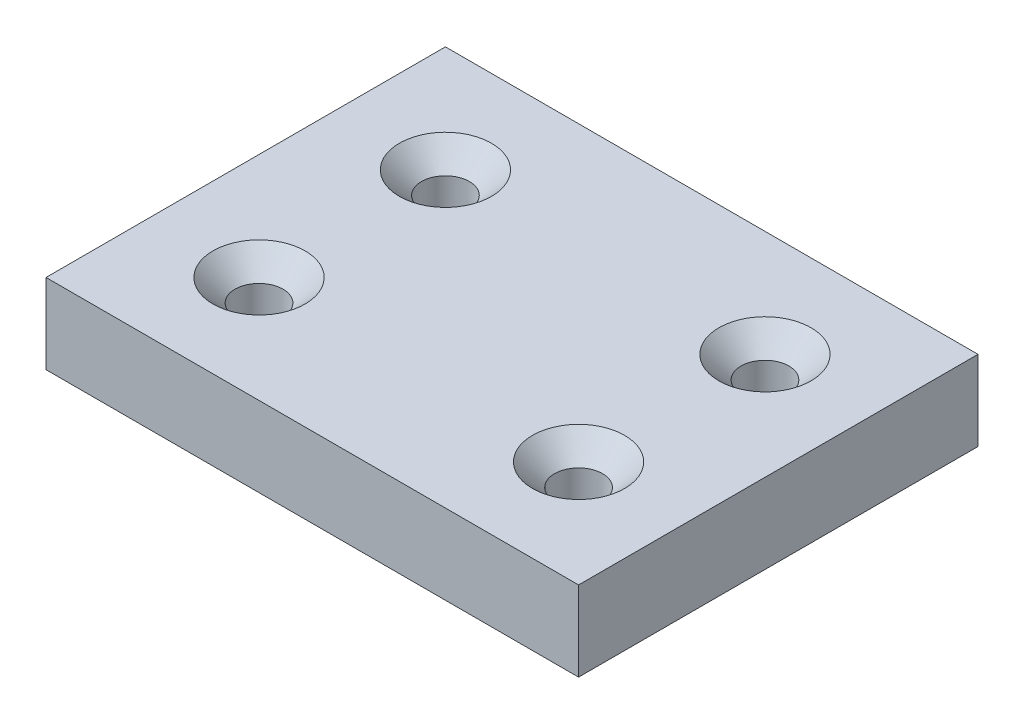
from build123d import *

# Parameters (mm, degrees)
SKETCH1_W                                       = 100
SKETCH1_H                                       = 75
BOSS_EXTRUDE1_DEPTH                             = 15
CSK_FOR_M8_FLAT_HEAD_MACHINE_SCREW1_D           = 9
CSK_FOR_M8_FLAT_HEAD_MACHINE_SCREW1_CSINK_D     = 17.3
CSK_FOR_M8_FLAT_HEAD_MACHINE_SCREW1_CSINK_ANGLE = 90


with BuildPart() as part:
    # Sketch1 → Boss-Extrude1 (new body)
    with BuildSketch(Plane(origin=(0, 0, 0), x_dir=(1, 0, 0), z_dir=(0, 1, 0))):
        Rectangle(SKETCH1_W, SKETCH1_H)
    extrude(amount=BOSS_EXTRUDE1_DEPTH)

    # CSK for M8 Flat Head Machine Screw1 (through all)
    with Locations(Plane(origin=(0, 15, 0), x_dir=(-1, 0, 0), z_dir=(0, 1, 0))):
        with Locations((30, 17.5), (30, -17.5), (-30, -17.5), (-30, 17.5)):
            CounterSinkHole(CSK_FOR_M8_FLAT_HEAD_MACHINE_SCREW1_D / 2, CSK_FOR_M8_FLAT_HEAD_MACHINE_SCREW1_CSINK_D / 2, counter_sink_angle=CSK_FOR_M8_FLAT_HEAD_MACHINE_SCREW1_CSINK_ANGLE)


solid = part.part
